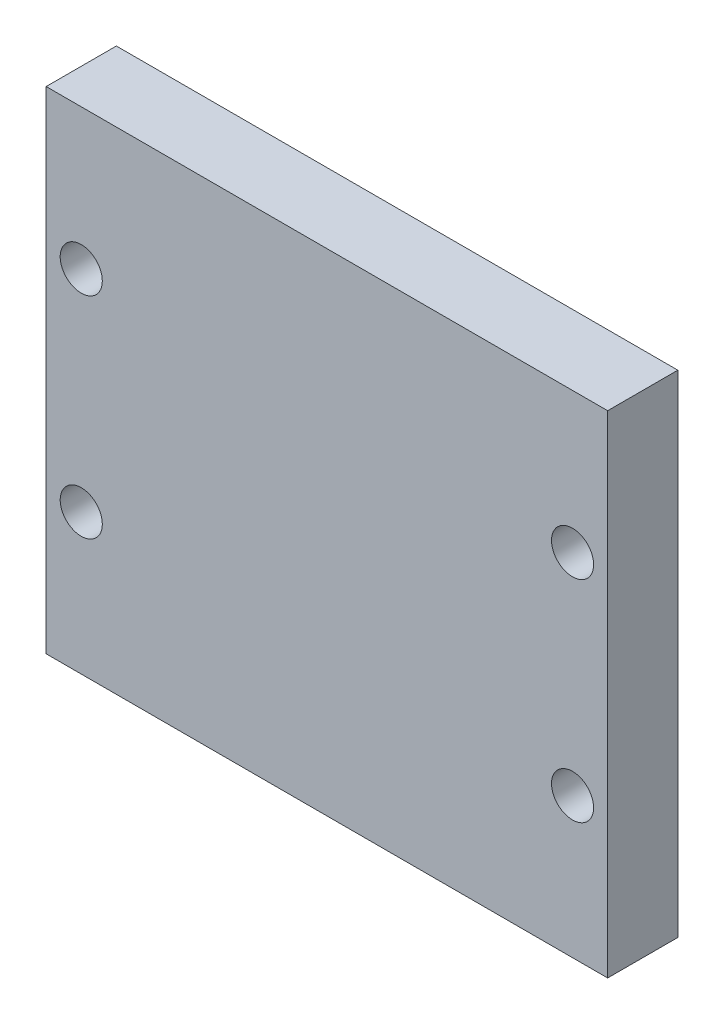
ISO-10303-21;
HEADER;
FILE_DESCRIPTION(('STEP AP214'),'2;1');
FILE_NAME('part.step','',(''),(''),'','','');
FILE_SCHEMA(('AUTOMOTIVE_DESIGN { 1 0 10303 214 1 1 1 1 }'));
ENDSEC;
DATA;
#1=APPLICATION_CONTEXT('core data for automotive mechanical design processes');
#2=APPLICATION_PROTOCOL_DEFINITION('international standard','automotive_design',2000,#1);
#3=PRODUCT_CONTEXT('',#1,'mechanical');
#4=PRODUCT('Part','Part','',(#3));
#5=PRODUCT_RELATED_PRODUCT_CATEGORY('part','',(#4));
#6=PRODUCT_DEFINITION_FORMATION('','',#4);
#7=PRODUCT_DEFINITION_CONTEXT('part definition',#1,'design');
#8=PRODUCT_DEFINITION('design','',#6,#7);
#9=PRODUCT_DEFINITION_SHAPE('','',#8);
#10=(LENGTH_UNIT() NAMED_UNIT(*) SI_UNIT(.MILLI.,.METRE.));
#11=(NAMED_UNIT(*) PLANE_ANGLE_UNIT() SI_UNIT($,.RADIAN.));
#12=(NAMED_UNIT(*) SI_UNIT($,.STERADIAN.) SOLID_ANGLE_UNIT());
#13=UNCERTAINTY_MEASURE_WITH_UNIT(LENGTH_MEASURE(1.E-05),#10,'distance_accuracy_value','');
#14=(GEOMETRIC_REPRESENTATION_CONTEXT(3) GLOBAL_UNCERTAINTY_ASSIGNED_CONTEXT((#13)) GLOBAL_UNIT_ASSIGNED_CONTEXT((#10,
#11,#12)) REPRESENTATION_CONTEXT('',''));
#15=CARTESIAN_POINT('',(0.,0.,0.));
#16=DIRECTION('',(0.,0.,1.));
#17=DIRECTION('',(1.,0.,0.));
#18=AXIS2_PLACEMENT_3D('',#15,#16,#17);
#19=CARTESIAN_POINT('',(0.,0.,5.));
#20=DIRECTION('',(0.,0.,1.));
#21=DIRECTION('',(1.,0.,0.));
#22=AXIS2_PLACEMENT_3D('',#19,#20,#21);
#23=PLANE('',#22);
#24=CARTESIAN_POINT('',(17.6,-181.001750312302,5.));
#25=DIRECTION('',(0.,0.,1.));
#26=DIRECTION('',(1.,0.,0.));
#27=AXIS2_PLACEMENT_3D('',#24,#25,#26);
#28=CIRCLE('',#27,1.5);
#29=CARTESIAN_POINT('',(19.1,-181.001750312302,5.));
#30=VERTEX_POINT('',#29);
#31=EDGE_CURVE('E130',#30,#30,#28,.T.);
#32=ORIENTED_EDGE('',*,*,#31,.F.);
#33=EDGE_LOOP('',(#32));
#34=FACE_BOUND('',#33,.T.);
#35=CARTESIAN_POINT('',(-17.4,-166.001750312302,5.));
#36=DIRECTION('',(0.,0.,1.));
#37=DIRECTION('',(1.,0.,0.));
#38=AXIS2_PLACEMENT_3D('',#35,#36,#37);
#39=CIRCLE('',#38,1.5);
#40=CARTESIAN_POINT('',(-15.9,-166.001750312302,5.));
#41=VERTEX_POINT('',#40);
#42=EDGE_CURVE('E106',#41,#41,#39,.T.);
#43=ORIENTED_EDGE('',*,*,#42,.F.);
#44=EDGE_LOOP('',(#43));
#45=FACE_BOUND('',#44,.T.);
#46=DIRECTION('',(0.,-1.,0.));
#47=VECTOR('',#46,1.);
#48=CARTESIAN_POINT('',(-19.9,-156.001750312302,5.));
#49=LINE('',#48,#47);
#50=CARTESIAN_POINT('',(-19.9,-156.001750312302,5.));
#51=VERTEX_POINT('',#50);
#52=CARTESIAN_POINT('',(-19.9,-191.001750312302,5.));
#53=VERTEX_POINT('',#52);
#54=EDGE_CURVE('E93',#51,#53,#49,.T.);
#55=ORIENTED_EDGE('',*,*,#54,.T.);
#56=DIRECTION('',(1.,0.,0.));
#57=VECTOR('',#56,1.);
#58=CARTESIAN_POINT('',(-19.9,-191.001750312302,5.));
#59=LINE('',#58,#57);
#60=CARTESIAN_POINT('',(20.1,-191.001750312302,5.));
#61=VERTEX_POINT('',#60);
#62=EDGE_CURVE('E88',#53,#61,#59,.T.);
#63=ORIENTED_EDGE('',*,*,#62,.T.);
#64=DIRECTION('',(0.,1.,0.));
#65=VECTOR('',#64,1.);
#66=CARTESIAN_POINT('',(20.1,-156.001750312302,5.));
#67=LINE('',#66,#65);
#68=CARTESIAN_POINT('',(20.1,-156.001750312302,5.));
#69=VERTEX_POINT('',#68);
#70=EDGE_CURVE('E90',#61,#69,#67,.T.);
#71=ORIENTED_EDGE('',*,*,#70,.T.);
#72=DIRECTION('',(-1.,0.,0.));
#73=VECTOR('',#72,1.);
#74=CARTESIAN_POINT('',(-19.9,-156.001750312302,5.));
#75=LINE('',#74,#73);
#76=EDGE_CURVE('E57',#69,#51,#75,.T.);
#77=ORIENTED_EDGE('',*,*,#76,.T.);
#78=EDGE_LOOP('',(#55,#63,#71,#77));
#79=FACE_BOUND('',#78,.T.);
#80=CARTESIAN_POINT('',(-17.4,-181.001750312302,5.));
#81=DIRECTION('',(0.,0.,1.));
#82=DIRECTION('',(1.,0.,0.));
#83=AXIS2_PLACEMENT_3D('',#80,#81,#82);
#84=CIRCLE('',#83,1.5);
#85=CARTESIAN_POINT('',(-15.9,-181.001750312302,5.));
#86=VERTEX_POINT('',#85);
#87=EDGE_CURVE('E123',#86,#86,#84,.T.);
#88=ORIENTED_EDGE('',*,*,#87,.F.);
#89=EDGE_LOOP('',(#88));
#90=FACE_BOUND('',#89,.T.);
#91=CARTESIAN_POINT('',(17.6,-166.001750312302,5.));
#92=DIRECTION('',(0.,0.,1.));
#93=DIRECTION('',(1.,0.,0.));
#94=AXIS2_PLACEMENT_3D('',#91,#92,#93);
#95=CIRCLE('',#94,1.5);
#96=CARTESIAN_POINT('',(19.1,-166.001750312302,5.));
#97=VERTEX_POINT('',#96);
#98=EDGE_CURVE('E134',#97,#97,#95,.T.);
#99=ORIENTED_EDGE('',*,*,#98,.F.);
#100=EDGE_LOOP('',(#99));
#101=FACE_BOUND('',#100,.T.);
#102=ADVANCED_FACE('F39',(#34,#45,#79,#90,#101),#23,.T.);
#103=CARTESIAN_POINT('',(0.,0.,0.));
#104=DIRECTION('',(0.,0.,1.));
#105=DIRECTION('',(1.,0.,0.));
#106=AXIS2_PLACEMENT_3D('',#103,#104,#105);
#107=PLANE('',#106);
#108=DIRECTION('',(0.,-1.,0.));
#109=VECTOR('',#108,1.);
#110=CARTESIAN_POINT('',(-19.9,-156.001750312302,0.));
#111=LINE('',#110,#109);
#112=CARTESIAN_POINT('',(-19.9,-156.001750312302,0.));
#113=VERTEX_POINT('',#112);
#114=CARTESIAN_POINT('',(-19.9,-191.001750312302,0.));
#115=VERTEX_POINT('',#114);
#116=EDGE_CURVE('E103',#113,#115,#111,.T.);
#117=ORIENTED_EDGE('',*,*,#116,.F.);
#118=DIRECTION('',(-1.,0.,0.));
#119=VECTOR('',#118,1.);
#120=CARTESIAN_POINT('',(-19.9,-156.001750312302,0.));
#121=LINE('',#120,#119);
#122=CARTESIAN_POINT('',(20.1,-156.001750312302,0.));
#123=VERTEX_POINT('',#122);
#124=EDGE_CURVE('E76',#123,#113,#121,.T.);
#125=ORIENTED_EDGE('',*,*,#124,.F.);
#126=DIRECTION('',(0.,1.,0.));
#127=VECTOR('',#126,1.);
#128=CARTESIAN_POINT('',(20.1,-156.001750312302,0.));
#129=LINE('',#128,#127);
#130=CARTESIAN_POINT('',(20.1,-191.001750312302,0.));
#131=VERTEX_POINT('',#130);
#132=EDGE_CURVE('E71',#131,#123,#129,.T.);
#133=ORIENTED_EDGE('',*,*,#132,.F.);
#134=DIRECTION('',(1.,0.,0.));
#135=VECTOR('',#134,1.);
#136=CARTESIAN_POINT('',(-19.9,-191.001750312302,0.));
#137=LINE('',#136,#135);
#138=EDGE_CURVE('E92',#115,#131,#137,.T.);
#139=ORIENTED_EDGE('',*,*,#138,.F.);
#140=EDGE_LOOP('',(#117,#125,#133,#139));
#141=FACE_BOUND('',#140,.T.);
#142=CARTESIAN_POINT('',(-17.4,-166.001750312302,0.));
#143=DIRECTION('',(0.,0.,1.));
#144=DIRECTION('',(1.,0.,0.));
#145=AXIS2_PLACEMENT_3D('',#142,#143,#144);
#146=CIRCLE('',#145,1.5);
#147=CARTESIAN_POINT('',(-15.9,-166.001750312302,0.));
#148=VERTEX_POINT('',#147);
#149=EDGE_CURVE('E119',#148,#148,#146,.T.);
#150=ORIENTED_EDGE('',*,*,#149,.T.);
#151=EDGE_LOOP('',(#150));
#152=FACE_BOUND('',#151,.T.);
#153=CARTESIAN_POINT('',(-17.4,-181.001750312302,0.));
#154=DIRECTION('',(0.,0.,1.));
#155=DIRECTION('',(1.,0.,0.));
#156=AXIS2_PLACEMENT_3D('',#153,#154,#155);
#157=CIRCLE('',#156,1.5);
#158=CARTESIAN_POINT('',(-15.9,-181.001750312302,0.));
#159=VERTEX_POINT('',#158);
#160=EDGE_CURVE('E124',#159,#159,#157,.T.);
#161=ORIENTED_EDGE('',*,*,#160,.T.);
#162=EDGE_LOOP('',(#161));
#163=FACE_BOUND('',#162,.T.);
#164=CARTESIAN_POINT('',(17.6,-181.001750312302,0.));
#165=DIRECTION('',(0.,0.,1.));
#166=DIRECTION('',(1.,0.,0.));
#167=AXIS2_PLACEMENT_3D('',#164,#165,#166);
#168=CIRCLE('',#167,1.5);
#169=CARTESIAN_POINT('',(19.1,-181.001750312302,0.));
#170=VERTEX_POINT('',#169);
#171=EDGE_CURVE('E128',#170,#170,#168,.T.);
#172=ORIENTED_EDGE('',*,*,#171,.T.);
#173=EDGE_LOOP('',(#172));
#174=FACE_BOUND('',#173,.T.);
#175=CARTESIAN_POINT('',(17.6,-166.001750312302,0.));
#176=DIRECTION('',(0.,0.,1.));
#177=DIRECTION('',(1.,0.,0.));
#178=AXIS2_PLACEMENT_3D('',#175,#176,#177);
#179=CIRCLE('',#178,1.5);
#180=CARTESIAN_POINT('',(19.1,-166.001750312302,0.));
#181=VERTEX_POINT('',#180);
#182=EDGE_CURVE('E138',#181,#181,#179,.T.);
#183=ORIENTED_EDGE('',*,*,#182,.T.);
#184=EDGE_LOOP('',(#183));
#185=FACE_BOUND('',#184,.T.);
#186=ADVANCED_FACE('F111',(#141,#152,#163,#174,#185),#107,.F.);
#187=CARTESIAN_POINT('',(-19.9,-156.001750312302,5.));
#188=DIRECTION('',(1.,0.,0.));
#189=DIRECTION('',(0.,1.,0.));
#190=AXIS2_PLACEMENT_3D('',#187,#188,#189);
#191=PLANE('',#190);
#192=ORIENTED_EDGE('',*,*,#116,.T.);
#193=DIRECTION('',(0.,0.,-1.));
#194=VECTOR('',#193,1.);
#195=CARTESIAN_POINT('',(-19.9,-191.001750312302,5.));
#196=LINE('',#195,#194);
#197=EDGE_CURVE('E11',#53,#115,#196,.T.);
#198=ORIENTED_EDGE('',*,*,#197,.F.);
#199=ORIENTED_EDGE('',*,*,#54,.F.);
#200=DIRECTION('',(0.,0.,-1.));
#201=VECTOR('',#200,1.);
#202=CARTESIAN_POINT('',(-19.9,-156.001750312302,5.));
#203=LINE('',#202,#201);
#204=EDGE_CURVE('E97',#51,#113,#203,.T.);
#205=ORIENTED_EDGE('',*,*,#204,.T.);
#206=EDGE_LOOP('',(#192,#198,#199,#205));
#207=FACE_BOUND('',#206,.T.);
#208=ADVANCED_FACE('F41',(#207),#191,.F.);
#209=CARTESIAN_POINT('',(-19.9,-191.001750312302,5.));
#210=DIRECTION('',(0.,1.,0.));
#211=DIRECTION('',(0.,0.,1.));
#212=AXIS2_PLACEMENT_3D('',#209,#210,#211);
#213=PLANE('',#212);
#214=ORIENTED_EDGE('',*,*,#138,.T.);
#215=DIRECTION('',(0.,0.,-1.));
#216=VECTOR('',#215,1.);
#217=CARTESIAN_POINT('',(20.1,-191.001750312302,5.));
#218=LINE('',#217,#216);
#219=EDGE_CURVE('E48',#61,#131,#218,.T.);
#220=ORIENTED_EDGE('',*,*,#219,.F.);
#221=ORIENTED_EDGE('',*,*,#62,.F.);
#222=ORIENTED_EDGE('',*,*,#197,.T.);
#223=EDGE_LOOP('',(#214,#220,#221,#222));
#224=FACE_BOUND('',#223,.T.);
#225=ADVANCED_FACE('F94',(#224),#213,.F.);
#226=CARTESIAN_POINT('',(20.1,-156.001750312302,5.));
#227=DIRECTION('',(-1.,0.,0.));
#228=DIRECTION('',(0.,-1.,0.));
#229=AXIS2_PLACEMENT_3D('',#226,#227,#228);
#230=PLANE('',#229);
#231=ORIENTED_EDGE('',*,*,#132,.T.);
#232=DIRECTION('',(0.,0.,-1.));
#233=VECTOR('',#232,1.);
#234=CARTESIAN_POINT('',(20.1,-156.001750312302,5.));
#235=LINE('',#234,#233);
#236=EDGE_CURVE('E96',#69,#123,#235,.T.);
#237=ORIENTED_EDGE('',*,*,#236,.F.);
#238=ORIENTED_EDGE('',*,*,#70,.F.);
#239=ORIENTED_EDGE('',*,*,#219,.T.);
#240=EDGE_LOOP('',(#231,#237,#238,#239));
#241=FACE_BOUND('',#240,.T.);
#242=ADVANCED_FACE('F100',(#241),#230,.F.);
#243=CARTESIAN_POINT('',(-19.9,-156.001750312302,5.));
#244=DIRECTION('',(0.,-1.,0.));
#245=DIRECTION('',(0.,0.,-1.));
#246=AXIS2_PLACEMENT_3D('',#243,#244,#245);
#247=PLANE('',#246);
#248=ORIENTED_EDGE('',*,*,#124,.T.);
#249=ORIENTED_EDGE('',*,*,#204,.F.);
#250=ORIENTED_EDGE('',*,*,#76,.F.);
#251=ORIENTED_EDGE('',*,*,#236,.T.);
#252=EDGE_LOOP('',(#248,#249,#250,#251));
#253=FACE_BOUND('',#252,.T.);
#254=ADVANCED_FACE('F112',(#253),#247,.F.);
#255=CARTESIAN_POINT('',(-17.4,-166.001750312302,5.));
#256=DIRECTION('',(0.,0.,-1.));
#257=DIRECTION('',(-1.,0.,0.));
#258=AXIS2_PLACEMENT_3D('',#255,#256,#257);
#259=CYLINDRICAL_SURFACE('',#258,1.5);
#260=ORIENTED_EDGE('',*,*,#42,.T.);
#261=EDGE_LOOP('',(#260));
#262=FACE_BOUND('',#261,.T.);
#263=ORIENTED_EDGE('',*,*,#149,.F.);
#264=EDGE_LOOP('',(#263));
#265=FACE_BOUND('',#264,.T.);
#266=ADVANCED_FACE('F154',(#262,#265),#259,.F.);
#267=CARTESIAN_POINT('',(-17.4,-181.001750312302,5.));
#268=DIRECTION('',(0.,0.,-1.));
#269=DIRECTION('',(-1.,0.,0.));
#270=AXIS2_PLACEMENT_3D('',#267,#268,#269);
#271=CYLINDRICAL_SURFACE('',#270,1.5);
#272=ORIENTED_EDGE('',*,*,#87,.T.);
#273=EDGE_LOOP('',(#272));
#274=FACE_BOUND('',#273,.T.);
#275=ORIENTED_EDGE('',*,*,#160,.F.);
#276=EDGE_LOOP('',(#275));
#277=FACE_BOUND('',#276,.T.);
#278=ADVANCED_FACE('F199',(#274,#277),#271,.F.);
#279=CARTESIAN_POINT('',(17.6,-181.001750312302,5.));
#280=DIRECTION('',(0.,0.,-1.));
#281=DIRECTION('',(-1.,0.,0.));
#282=AXIS2_PLACEMENT_3D('',#279,#280,#281);
#283=CYLINDRICAL_SURFACE('',#282,1.5);
#284=ORIENTED_EDGE('',*,*,#31,.T.);
#285=EDGE_LOOP('',(#284));
#286=FACE_BOUND('',#285,.T.);
#287=ORIENTED_EDGE('',*,*,#171,.F.);
#288=EDGE_LOOP('',(#287));
#289=FACE_BOUND('',#288,.T.);
#290=ADVANCED_FACE('F208',(#286,#289),#283,.F.);
#291=CARTESIAN_POINT('',(17.6,-166.001750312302,5.));
#292=DIRECTION('',(0.,0.,-1.));
#293=DIRECTION('',(-1.,0.,0.));
#294=AXIS2_PLACEMENT_3D('',#291,#292,#293);
#295=CYLINDRICAL_SURFACE('',#294,1.5);
#296=ORIENTED_EDGE('',*,*,#98,.T.);
#297=EDGE_LOOP('',(#296));
#298=FACE_BOUND('',#297,.T.);
#299=ORIENTED_EDGE('',*,*,#182,.F.);
#300=EDGE_LOOP('',(#299));
#301=FACE_BOUND('',#300,.T.);
#302=ADVANCED_FACE('F142',(#298,#301),#295,.F.);
#303=CLOSED_SHELL('',(#102,#186,#208,#225,#242,#254,#266,#278,#290,#302));
#304=MANIFOLD_SOLID_BREP('B2',#303);
#305=ADVANCED_BREP_SHAPE_REPRESENTATION('',(#18,#304),#14);
#306=SHAPE_DEFINITION_REPRESENTATION(#9,#305);
ENDSEC;
END-ISO-10303-21;
